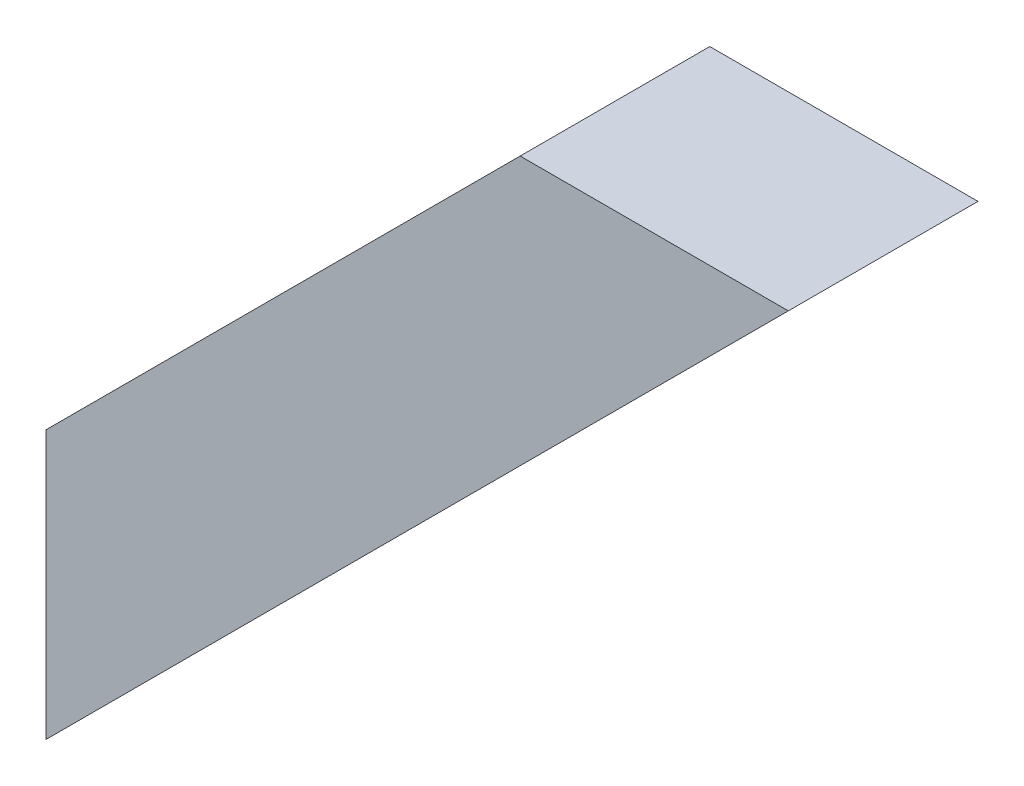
ISO-10303-21;
HEADER;
FILE_DESCRIPTION(('STEP AP214'),'2;1');
FILE_NAME('part.step','',(''),(''),'','','');
FILE_SCHEMA(('AUTOMOTIVE_DESIGN { 1 0 10303 214 1 1 1 1 }'));
ENDSEC;
DATA;
#1=APPLICATION_CONTEXT('core data for automotive mechanical design processes');
#2=APPLICATION_PROTOCOL_DEFINITION('international standard','automotive_design',2000,#1);
#3=PRODUCT_CONTEXT('',#1,'mechanical');
#4=PRODUCT('Part','Part','',(#3));
#5=PRODUCT_RELATED_PRODUCT_CATEGORY('part','',(#4));
#6=PRODUCT_DEFINITION_FORMATION('','',#4);
#7=PRODUCT_DEFINITION_CONTEXT('part definition',#1,'design');
#8=PRODUCT_DEFINITION('design','',#6,#7);
#9=PRODUCT_DEFINITION_SHAPE('','',#8);
#10=(LENGTH_UNIT() NAMED_UNIT(*) SI_UNIT(.MILLI.,.METRE.));
#11=(NAMED_UNIT(*) PLANE_ANGLE_UNIT() SI_UNIT($,.RADIAN.));
#12=(NAMED_UNIT(*) SI_UNIT($,.STERADIAN.) SOLID_ANGLE_UNIT());
#13=UNCERTAINTY_MEASURE_WITH_UNIT(LENGTH_MEASURE(1.E-05),#10,'distance_accuracy_value','');
#14=(GEOMETRIC_REPRESENTATION_CONTEXT(3) GLOBAL_UNCERTAINTY_ASSIGNED_CONTEXT((#13)) GLOBAL_UNIT_ASSIGNED_CONTEXT((#10,
#11,#12)) REPRESENTATION_CONTEXT('',''));
#15=CARTESIAN_POINT('',(0.,0.,0.));
#16=DIRECTION('',(0.,0.,1.));
#17=DIRECTION('',(1.,0.,0.));
#18=AXIS2_PLACEMENT_3D('',#15,#16,#17);
#19=CARTESIAN_POINT('',(0.,-300.,120.));
#20=DIRECTION('',(1.,0.,0.));
#21=DIRECTION('',(0.,1.,0.));
#22=AXIS2_PLACEMENT_3D('',#19,#20,#21);
#23=PLANE('',#22);
#24=DIRECTION('',(0.,-1.,0.));
#25=VECTOR('',#24,1.);
#26=CARTESIAN_POINT('',(0.,-300.,0.));
#27=LINE('',#26,#25);
#28=CARTESIAN_POINT('',(0.,-300.,0.));
#29=VERTEX_POINT('',#28);
#30=CARTESIAN_POINT('',(0.,-469.705627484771,0.));
#31=VERTEX_POINT('',#30);
#32=EDGE_CURVE('E103',#29,#31,#27,.T.);
#33=ORIENTED_EDGE('',*,*,#32,.T.);
#34=DIRECTION('',(0.,0.,-1.));
#35=VECTOR('',#34,1.);
#36=CARTESIAN_POINT('',(0.,-469.705627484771,120.));
#37=LINE('',#36,#35);
#38=CARTESIAN_POINT('',(0.,-469.705627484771,120.));
#39=VERTEX_POINT('',#38);
#40=EDGE_CURVE('E11',#39,#31,#37,.T.);
#41=ORIENTED_EDGE('',*,*,#40,.F.);
#42=DIRECTION('',(0.,-1.,0.));
#43=VECTOR('',#42,1.);
#44=CARTESIAN_POINT('',(0.,-300.,120.));
#45=LINE('',#44,#43);
#46=CARTESIAN_POINT('',(0.,-300.,120.));
#47=VERTEX_POINT('',#46);
#48=EDGE_CURVE('E91',#47,#39,#45,.T.);
#49=ORIENTED_EDGE('',*,*,#48,.F.);
#50=DIRECTION('',(0.,0.,-1.));
#51=VECTOR('',#50,1.);
#52=CARTESIAN_POINT('',(0.,-300.,120.));
#53=LINE('',#52,#51);
#54=EDGE_CURVE('E99',#47,#29,#53,.T.);
#55=ORIENTED_EDGE('',*,*,#54,.T.);
#56=EDGE_LOOP('',(#33,#41,#49,#55));
#57=FACE_BOUND('',#56,.T.);
#58=ADVANCED_FACE('F40',(#57),#23,.F.);
#59=CARTESIAN_POINT('',(84.8528137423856,-384.852813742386,120.));
#60=DIRECTION('',(-0.707106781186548,0.707106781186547,0.));
#61=DIRECTION('',(-0.707106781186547,-0.707106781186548,0.));
#62=AXIS2_PLACEMENT_3D('',#59,#60,#61);
#63=PLANE('',#62);
#64=DIRECTION('',(0.707106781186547,0.707106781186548,0.));
#65=VECTOR('',#64,1.);
#66=CARTESIAN_POINT('',(84.8528137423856,-384.852813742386,0.));
#67=LINE('',#66,#65);
#68=CARTESIAN_POINT('',(469.705627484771,0.,0.));
#69=VERTEX_POINT('',#68);
#70=EDGE_CURVE('E95',#31,#69,#67,.T.);
#71=ORIENTED_EDGE('',*,*,#70,.T.);
#72=DIRECTION('',(0.,0.,-1.));
#73=VECTOR('',#72,1.);
#74=CARTESIAN_POINT('',(469.705627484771,0.,120.));
#75=LINE('',#74,#73);
#76=CARTESIAN_POINT('',(469.705627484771,0.,120.));
#77=VERTEX_POINT('',#76);
#78=EDGE_CURVE('E48',#77,#69,#75,.T.);
#79=ORIENTED_EDGE('',*,*,#78,.F.);
#80=DIRECTION('',(0.707106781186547,0.707106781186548,0.));
#81=VECTOR('',#80,1.);
#82=CARTESIAN_POINT('',(0.,-469.705627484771,120.));
#83=LINE('',#82,#81);
#84=EDGE_CURVE('E86',#39,#77,#83,.T.);
#85=ORIENTED_EDGE('',*,*,#84,.F.);
#86=ORIENTED_EDGE('',*,*,#40,.T.);
#87=EDGE_LOOP('',(#71,#79,#85,#86));
#88=FACE_BOUND('',#87,.T.);
#89=ADVANCED_FACE('F94',(#88),#63,.F.);
#90=CARTESIAN_POINT('',(300.,0.,120.));
#91=DIRECTION('',(0.,-1.,0.));
#92=DIRECTION('',(1.,0.,0.));
#93=AXIS2_PLACEMENT_3D('',#90,#91,#92);
#94=PLANE('',#93);
#95=DIRECTION('',(-1.,0.,0.));
#96=VECTOR('',#95,1.);
#97=CARTESIAN_POINT('',(300.,0.,0.));
#98=LINE('',#97,#96);
#99=CARTESIAN_POINT('',(300.,0.,0.));
#100=VERTEX_POINT('',#99);
#101=EDGE_CURVE('E73',#69,#100,#98,.T.);
#102=ORIENTED_EDGE('',*,*,#101,.T.);
#103=DIRECTION('',(0.,0.,-1.));
#104=VECTOR('',#103,1.);
#105=CARTESIAN_POINT('',(300.,0.,120.));
#106=LINE('',#105,#104);
#107=CARTESIAN_POINT('',(300.,0.,120.));
#108=VERTEX_POINT('',#107);
#109=EDGE_CURVE('E96',#108,#100,#106,.T.);
#110=ORIENTED_EDGE('',*,*,#109,.F.);
#111=DIRECTION('',(-1.,0.,0.));
#112=VECTOR('',#111,1.);
#113=CARTESIAN_POINT('',(300.,0.,120.));
#114=LINE('',#113,#112);
#115=EDGE_CURVE('E89',#77,#108,#114,.T.);
#116=ORIENTED_EDGE('',*,*,#115,.F.);
#117=ORIENTED_EDGE('',*,*,#78,.T.);
#118=EDGE_LOOP('',(#102,#110,#116,#117));
#119=FACE_BOUND('',#118,.T.);
#120=ADVANCED_FACE('F97',(#119),#94,.F.);
#121=CARTESIAN_POINT('',(0.,-300.,120.));
#122=DIRECTION('',(0.707106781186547,-0.707106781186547,0.));
#123=DIRECTION('',(0.707106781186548,0.707106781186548,0.));
#124=AXIS2_PLACEMENT_3D('',#121,#122,#123);
#125=PLANE('',#124);
#126=DIRECTION('',(-0.707106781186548,-0.707106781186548,0.));
#127=VECTOR('',#126,1.);
#128=CARTESIAN_POINT('',(0.,-300.,0.));
#129=LINE('',#128,#127);
#130=EDGE_CURVE('E79',#100,#29,#129,.T.);
#131=ORIENTED_EDGE('',*,*,#130,.T.);
#132=ORIENTED_EDGE('',*,*,#54,.F.);
#133=DIRECTION('',(-0.707106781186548,-0.707106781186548,0.));
#134=VECTOR('',#133,1.);
#135=CARTESIAN_POINT('',(0.,-300.,120.));
#136=LINE('',#135,#134);
#137=EDGE_CURVE('E56',#108,#47,#136,.T.);
#138=ORIENTED_EDGE('',*,*,#137,.F.);
#139=ORIENTED_EDGE('',*,*,#109,.T.);
#140=EDGE_LOOP('',(#131,#132,#138,#139));
#141=FACE_BOUND('',#140,.T.);
#142=ADVANCED_FACE('F110',(#141),#125,.F.);
#143=CARTESIAN_POINT('',(0.,0.,120.));
#144=DIRECTION('',(0.,0.,1.));
#145=DIRECTION('',(1.,0.,0.));
#146=AXIS2_PLACEMENT_3D('',#143,#144,#145);
#147=PLANE('',#146);
#148=ORIENTED_EDGE('',*,*,#48,.T.);
#149=ORIENTED_EDGE('',*,*,#84,.T.);
#150=ORIENTED_EDGE('',*,*,#115,.T.);
#151=ORIENTED_EDGE('',*,*,#137,.T.);
#152=EDGE_LOOP('',(#148,#149,#150,#151));
#153=FACE_BOUND('',#152,.T.);
#154=ADVANCED_FACE('F87',(#153),#147,.T.);
#155=CARTESIAN_POINT('',(0.,0.,0.));
#156=DIRECTION('',(0.,0.,1.));
#157=DIRECTION('',(1.,0.,0.));
#158=AXIS2_PLACEMENT_3D('',#155,#156,#157);
#159=PLANE('',#158);
#160=ORIENTED_EDGE('',*,*,#32,.F.);
#161=ORIENTED_EDGE('',*,*,#130,.F.);
#162=ORIENTED_EDGE('',*,*,#101,.F.);
#163=ORIENTED_EDGE('',*,*,#70,.F.);
#164=EDGE_LOOP('',(#160,#161,#162,#163));
#165=FACE_BOUND('',#164,.T.);
#166=ADVANCED_FACE('F113',(#165),#159,.F.);
#167=CLOSED_SHELL('',(#58,#89,#120,#142,#154,#166));
#168=MANIFOLD_SOLID_BREP('B2',#167);
#169=ADVANCED_BREP_SHAPE_REPRESENTATION('',(#18,#168),#14);
#170=SHAPE_DEFINITION_REPRESENTATION(#9,#169);
ENDSEC;
END-ISO-10303-21;
